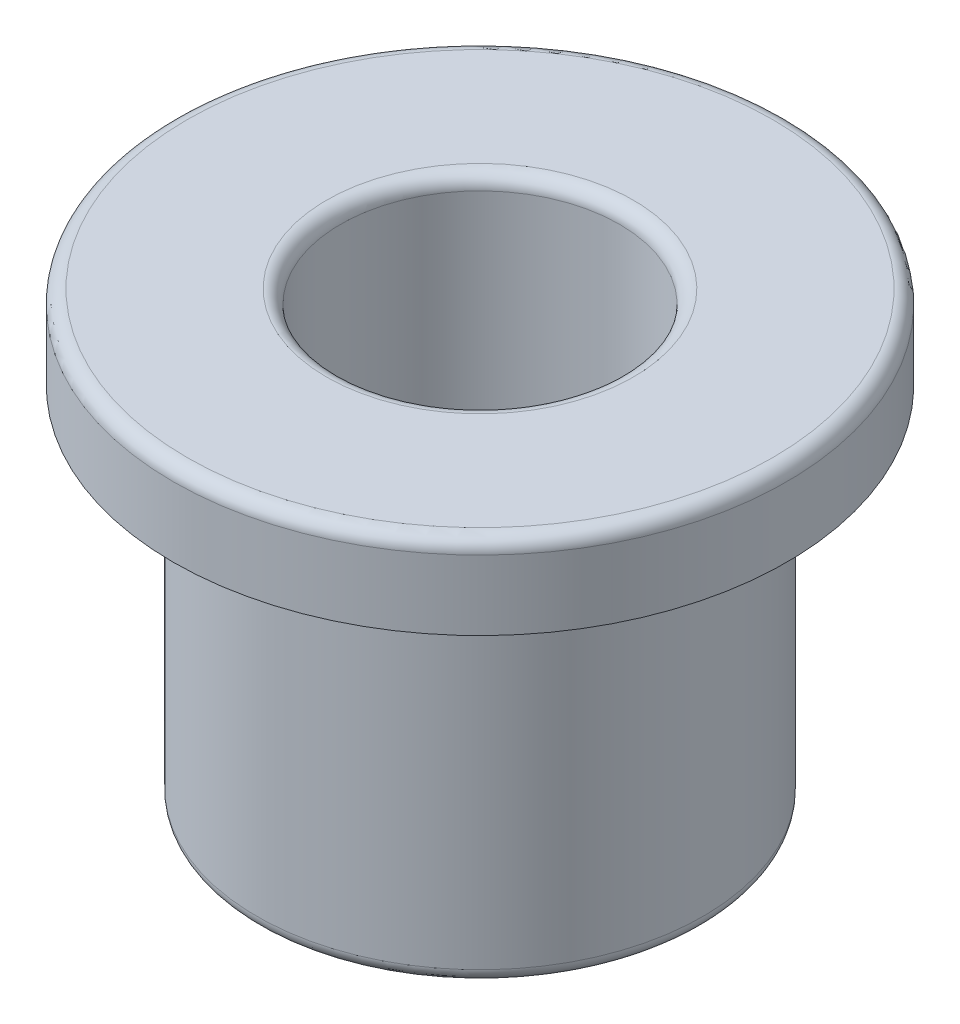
ISO-10303-21;
HEADER;
FILE_DESCRIPTION(('STEP AP214'),'2;1');
FILE_NAME('part.step','',(''),(''),'','','');
FILE_SCHEMA(('AUTOMOTIVE_DESIGN { 1 0 10303 214 1 1 1 1 }'));
ENDSEC;
DATA;
#1=APPLICATION_CONTEXT('core data for automotive mechanical design processes');
#2=APPLICATION_PROTOCOL_DEFINITION('international standard','automotive_design',2000,#1);
#3=PRODUCT_CONTEXT('',#1,'mechanical');
#4=PRODUCT('Part','Part','',(#3));
#5=PRODUCT_RELATED_PRODUCT_CATEGORY('part','',(#4));
#6=PRODUCT_DEFINITION_FORMATION('','',#4);
#7=PRODUCT_DEFINITION_CONTEXT('part definition',#1,'design');
#8=PRODUCT_DEFINITION('design','',#6,#7);
#9=PRODUCT_DEFINITION_SHAPE('','',#8);
#10=(LENGTH_UNIT() NAMED_UNIT(*) SI_UNIT(.MILLI.,.METRE.));
#11=(NAMED_UNIT(*) PLANE_ANGLE_UNIT() SI_UNIT($,.RADIAN.));
#12=(NAMED_UNIT(*) SI_UNIT($,.STERADIAN.) SOLID_ANGLE_UNIT());
#13=UNCERTAINTY_MEASURE_WITH_UNIT(LENGTH_MEASURE(1.E-05),#10,'distance_accuracy_value','');
#14=(GEOMETRIC_REPRESENTATION_CONTEXT(3) GLOBAL_UNCERTAINTY_ASSIGNED_CONTEXT((#13)) GLOBAL_UNIT_ASSIGNED_CONTEXT((#10,
#11,#12)) REPRESENTATION_CONTEXT('',''));
#15=CARTESIAN_POINT('',(0.,0.,0.));
#16=DIRECTION('',(0.,0.,1.));
#17=DIRECTION('',(1.,0.,0.));
#18=AXIS2_PLACEMENT_3D('',#15,#16,#17);
#19=CARTESIAN_POINT('',(0.,0.,0.));
#20=DIRECTION('',(0.,-0.999999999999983,0.));
#21=DIRECTION('',(0.,0.,-1.00000000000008));
#22=AXIS2_PLACEMENT_3D('',#19,#20,#21);
#23=CYLINDRICAL_SURFACE('',#22,5.);
#24=CARTESIAN_POINT('',(0.,15.4999999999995,0.));
#25=DIRECTION('',(0.,0.999999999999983,0.));
#26=DIRECTION('',(0.,0.,1.00000000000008));
#27=AXIS2_PLACEMENT_3D('',#24,#25,#26);
#28=CIRCLE('',#27,5.);
#29=CARTESIAN_POINT('',(0.,15.4999999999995,-5.00000000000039));
#30=VERTEX_POINT('',#29);
#31=EDGE_CURVE('E48',#30,#30,#28,.T.);
#32=CARTESIAN_POINT('',(0.,0.5,0.));
#33=DIRECTION('',(0.,-0.999999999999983,0.));
#34=DIRECTION('',(0.,0.,-1.00000000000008));
#35=AXIS2_PLACEMENT_3D('',#32,#33,#34);
#36=CIRCLE('',#35,5.);
#37=CARTESIAN_POINT('',(0.,0.500000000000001,-5.00000000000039));
#38=VERTEX_POINT('',#37);
#39=EDGE_CURVE('E51',#38,#38,#36,.T.);
#40=CARTESIAN_POINT('',(0.,15.4999999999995,-5.00000000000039));
#41=CARTESIAN_POINT('',(0.,15.3437499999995,-5.00000000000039));
#42=CARTESIAN_POINT('',(0.,15.1874999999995,-5.00000000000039));
#43=CARTESIAN_POINT('',(0.,14.8749999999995,-5.00000000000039));
#44=CARTESIAN_POINT('',(0.,14.7187499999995,-5.00000000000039));
#45=CARTESIAN_POINT('',(0.,14.4062499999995,-5.00000000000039));
#46=CARTESIAN_POINT('',(0.,14.2499999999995,-5.00000000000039));
#47=CARTESIAN_POINT('',(0.,13.9374999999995,-5.00000000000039));
#48=CARTESIAN_POINT('',(0.,13.7812499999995,-5.00000000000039));
#49=CARTESIAN_POINT('',(0.,13.4687499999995,-5.00000000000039));
#50=CARTESIAN_POINT('',(0.,13.3124999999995,-5.00000000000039));
#51=CARTESIAN_POINT('',(0.,12.9999999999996,-5.00000000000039));
#52=CARTESIAN_POINT('',(0.,12.8437499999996,-5.00000000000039));
#53=CARTESIAN_POINT('',(0.,12.5312499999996,-5.00000000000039));
#54=CARTESIAN_POINT('',(0.,12.3749999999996,-5.00000000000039));
#55=CARTESIAN_POINT('',(0.,12.0624999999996,-5.00000000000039));
#56=CARTESIAN_POINT('',(0.,11.9062499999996,-5.00000000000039));
#57=CARTESIAN_POINT('',(0.,11.5937499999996,-5.00000000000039));
#58=CARTESIAN_POINT('',(0.,11.4374999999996,-5.00000000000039));
#59=CARTESIAN_POINT('',(0.,11.1249999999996,-5.00000000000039));
#60=CARTESIAN_POINT('',(0.,10.9687499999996,-5.00000000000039));
#61=CARTESIAN_POINT('',(0.,10.6562499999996,-5.00000000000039));
#62=CARTESIAN_POINT('',(0.,10.4999999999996,-5.00000000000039));
#63=CARTESIAN_POINT('',(0.,10.1874999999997,-5.00000000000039));
#64=CARTESIAN_POINT('',(0.,10.0312499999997,-5.00000000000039));
#65=CARTESIAN_POINT('',(0.,9.71874999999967,-5.00000000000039));
#66=CARTESIAN_POINT('',(0.,9.56249999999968,-5.00000000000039));
#67=CARTESIAN_POINT('',(0.,9.24999999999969,-5.00000000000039));
#68=CARTESIAN_POINT('',(0.,9.0937499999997,-5.00000000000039));
#69=CARTESIAN_POINT('',(0.,8.78124999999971,-5.00000000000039));
#70=CARTESIAN_POINT('',(0.,8.62499999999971,-5.00000000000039));
#71=CARTESIAN_POINT('',(0.,8.31249999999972,-5.00000000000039));
#72=CARTESIAN_POINT('',(0.,8.15624999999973,-5.00000000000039));
#73=CARTESIAN_POINT('',(0.,7.84374999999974,-5.00000000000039));
#74=CARTESIAN_POINT('',(0.,7.68749999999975,-5.00000000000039));
#75=CARTESIAN_POINT('',(0.,7.37499999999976,-5.00000000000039));
#76=CARTESIAN_POINT('',(0.,7.21874999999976,-5.00000000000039));
#77=CARTESIAN_POINT('',(0.,6.90624999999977,-5.00000000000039));
#78=CARTESIAN_POINT('',(0.,6.74999999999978,-5.00000000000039));
#79=CARTESIAN_POINT('',(0.,6.43749999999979,-5.00000000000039));
#80=CARTESIAN_POINT('',(0.,6.28124999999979,-5.00000000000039));
#81=CARTESIAN_POINT('',(0.,5.96874999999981,-5.00000000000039));
#82=CARTESIAN_POINT('',(0.,5.81249999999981,-5.00000000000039));
#83=CARTESIAN_POINT('',(0.,5.49999999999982,-5.00000000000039));
#84=CARTESIAN_POINT('',(0.,5.34374999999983,-5.00000000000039));
#85=CARTESIAN_POINT('',(0.,5.03124999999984,-5.00000000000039));
#86=CARTESIAN_POINT('',(0.,4.87499999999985,-5.00000000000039));
#87=CARTESIAN_POINT('',(0.,4.56249999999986,-5.00000000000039));
#88=CARTESIAN_POINT('',(0.,4.40624999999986,-5.00000000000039));
#89=CARTESIAN_POINT('',(0.,4.09374999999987,-5.00000000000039));
#90=CARTESIAN_POINT('',(0.,3.93749999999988,-5.00000000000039));
#91=CARTESIAN_POINT('',(0.,3.62499999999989,-5.00000000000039));
#92=CARTESIAN_POINT('',(0.,3.4687499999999,-5.00000000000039));
#93=CARTESIAN_POINT('',(0.,3.15624999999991,-5.00000000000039));
#94=CARTESIAN_POINT('',(0.,2.99999999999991,-5.00000000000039));
#95=CARTESIAN_POINT('',(0.,2.68749999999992,-5.00000000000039));
#96=CARTESIAN_POINT('',(0.,2.53124999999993,-5.00000000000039));
#97=CARTESIAN_POINT('',(0.,2.21874999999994,-5.00000000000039));
#98=CARTESIAN_POINT('',(0.,2.06249999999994,-5.00000000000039));
#99=CARTESIAN_POINT('',(0.,1.74999999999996,-5.00000000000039));
#100=CARTESIAN_POINT('',(0.,1.59374999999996,-5.00000000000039));
#101=CARTESIAN_POINT('',(0.,1.28124999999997,-5.00000000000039));
#102=CARTESIAN_POINT('',(0.,1.12499999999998,-5.00000000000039));
#103=CARTESIAN_POINT('',(0.,0.81249999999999,-5.00000000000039));
#104=CARTESIAN_POINT('',(0.,0.656249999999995,-5.00000000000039));
#105=CARTESIAN_POINT('',(0.,0.500000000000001,-5.00000000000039));
#106=B_SPLINE_CURVE_WITH_KNOTS('',3,(#40,#41,#42,#43,#44,#45,#46,#47,#48,#49,#50,#51,#52,#53,
#54,#55,#56,#57,#58,#59,#60,#61,#62,#63,#64,#65,#66,#67,#68,#69,#70,#71,#72,#73,#74,#75,#76,#77,
#78,#79,#80,#81,#82,#83,#84,#85,#86,#87,#88,#89,#90,#91,#92,#93,#94,#95,#96,#97,#98,#99,#100,
#101,#102,#103,#104,#105),.UNSPECIFIED.,.F.,.F.,(4,2,2,2,2,2,2,2,2,2,2,2,2,2,2,2,2,2,2,2,2,2,2,
2,2,2,2,2,2,2,2,2,4),(0.,0.468749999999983,0.937499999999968,1.40624999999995,1.87499999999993,
2.34374999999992,2.8124999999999,3.28124999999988,3.74999999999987,4.21874999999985,
4.68749999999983,5.15624999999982,5.6249999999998,6.09374999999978,6.56249999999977,
7.03124999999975,7.49999999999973,7.96874999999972,8.4374999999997,8.90624999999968,
9.37499999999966,9.84374999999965,10.3124999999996,10.7812499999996,11.2499999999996,
11.7187499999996,12.1874999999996,12.6562499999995,13.1249999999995,13.5937499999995,
14.0624999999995,14.5312499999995,14.9999999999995),.UNSPECIFIED.);
#107=EDGE_CURVE('BSEAM26',#30,#38,#106,.T.);
#108=ORIENTED_EDGE('',*,*,#31,.T.);
#109=ORIENTED_EDGE('',*,*,#39,.T.);
#110=ORIENTED_EDGE('',*,*,#107,.T.);
#111=ORIENTED_EDGE('',*,*,#107,.F.);
#112=EDGE_LOOP('',(#108,#110,#109,#111));
#113=FACE_BOUND('',#112,.T.);
#114=ADVANCED_FACE('F26',(#113),#23,.F.);
#115=CARTESIAN_POINT('',(5.00000000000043,15.9999999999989,0.));
#116=DIRECTION('',(0.,0.999999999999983,0.));
#117=DIRECTION('',(0.,0.,1.00000000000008));
#118=AXIS2_PLACEMENT_3D('',#115,#116,#117);
#119=PLANE('',#118);
#120=CARTESIAN_POINT('',(0.,15.9999999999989,0.));
#121=DIRECTION('',(0.,0.999999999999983,0.));
#122=DIRECTION('',(0.,0.,1.00000000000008));
#123=AXIS2_PLACEMENT_3D('',#120,#121,#122);
#124=CIRCLE('',#123,10.5);
#125=CARTESIAN_POINT('',(0.,15.9999999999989,10.5000000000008));
#126=VERTEX_POINT('',#125);
#127=EDGE_CURVE('E54',#126,#126,#124,.T.);
#128=ORIENTED_EDGE('',*,*,#127,.T.);
#129=EDGE_LOOP('',(#128));
#130=FACE_BOUND('',#129,.T.);
#131=CARTESIAN_POINT('',(0.,15.9999999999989,0.));
#132=DIRECTION('',(0.,0.999999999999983,0.));
#133=DIRECTION('',(0.,0.,1.00000000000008));
#134=AXIS2_PLACEMENT_3D('',#131,#132,#133);
#135=CIRCLE('',#134,5.5);
#136=CARTESIAN_POINT('',(0.,15.9999999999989,5.50000000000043));
#137=VERTEX_POINT('',#136);
#138=EDGE_CURVE('E57',#137,#137,#135,.F.);
#139=ORIENTED_EDGE('',*,*,#138,.T.);
#140=EDGE_LOOP('',(#139));
#141=FACE_BOUND('',#140,.T.);
#142=ADVANCED_FACE('F71',(#130,#141),#119,.T.);
#143=CARTESIAN_POINT('',(0.,0.,0.));
#144=DIRECTION('',(0.,-0.999999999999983,0.));
#145=DIRECTION('',(0.,0.,-1.00000000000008));
#146=AXIS2_PLACEMENT_3D('',#143,#144,#145);
#147=CYLINDRICAL_SURFACE('',#146,11.);
#148=CARTESIAN_POINT('',(0.,15.4999999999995,0.));
#149=DIRECTION('',(0.,0.999999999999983,0.));
#150=DIRECTION('',(0.,0.,1.00000000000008));
#151=AXIS2_PLACEMENT_3D('',#148,#149,#150);
#152=CIRCLE('',#151,11.);
#153=CARTESIAN_POINT('',(0.,15.4999999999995,-11.0000000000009));
#154=VERTEX_POINT('',#153);
#155=EDGE_CURVE('E60',#154,#154,#152,.F.);
#156=CARTESIAN_POINT('',(0.,12.9999999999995,0.));
#157=DIRECTION('',(0.,-0.999999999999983,0.));
#158=DIRECTION('',(0.,0.,-1.00000000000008));
#159=AXIS2_PLACEMENT_3D('',#156,#157,#158);
#160=CIRCLE('',#159,11.);
#161=CARTESIAN_POINT('',(0.,12.9999999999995,-11.0000000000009));
#162=VERTEX_POINT('',#161);
#163=EDGE_CURVE('E63',#162,#162,#160,.T.);
#164=CARTESIAN_POINT('',(0.,15.4999999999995,-11.0000000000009));
#165=CARTESIAN_POINT('',(0.,15.4739583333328,-11.0000000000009));
#166=CARTESIAN_POINT('',(0.,15.4479166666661,-11.0000000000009));
#167=CARTESIAN_POINT('',(0.,15.3958333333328,-11.0000000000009));
#168=CARTESIAN_POINT('',(0.,15.3697916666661,-11.0000000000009));
#169=CARTESIAN_POINT('',(0.,15.3177083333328,-11.0000000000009));
#170=CARTESIAN_POINT('',(0.,15.2916666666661,-11.0000000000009));
#171=CARTESIAN_POINT('',(0.,15.2395833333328,-11.0000000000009));
#172=CARTESIAN_POINT('',(0.,15.2135416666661,-11.0000000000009));
#173=CARTESIAN_POINT('',(0.,15.1614583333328,-11.0000000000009));
#174=CARTESIAN_POINT('',(0.,15.1354166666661,-11.0000000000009));
#175=CARTESIAN_POINT('',(0.,15.0833333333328,-11.0000000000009));
#176=CARTESIAN_POINT('',(0.,15.0572916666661,-11.0000000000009));
#177=CARTESIAN_POINT('',(0.,15.0052083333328,-11.0000000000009));
#178=CARTESIAN_POINT('',(0.,14.9791666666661,-11.0000000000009));
#179=CARTESIAN_POINT('',(0.,14.9270833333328,-11.0000000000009));
#180=CARTESIAN_POINT('',(0.,14.9010416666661,-11.0000000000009));
#181=CARTESIAN_POINT('',(0.,14.8489583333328,-11.0000000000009));
#182=CARTESIAN_POINT('',(0.,14.8229166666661,-11.0000000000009));
#183=CARTESIAN_POINT('',(0.,14.7708333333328,-11.0000000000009));
#184=CARTESIAN_POINT('',(0.,14.7447916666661,-11.0000000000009));
#185=CARTESIAN_POINT('',(0.,14.6927083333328,-11.0000000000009));
#186=CARTESIAN_POINT('',(0.,14.6666666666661,-11.0000000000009));
#187=CARTESIAN_POINT('',(0.,14.6145833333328,-11.0000000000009));
#188=CARTESIAN_POINT('',(0.,14.5885416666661,-11.0000000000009));
#189=CARTESIAN_POINT('',(0.,14.5364583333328,-11.0000000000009));
#190=CARTESIAN_POINT('',(0.,14.5104166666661,-11.0000000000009));
#191=CARTESIAN_POINT('',(0.,14.4583333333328,-11.0000000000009));
#192=CARTESIAN_POINT('',(0.,14.4322916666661,-11.0000000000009));
#193=CARTESIAN_POINT('',(0.,14.3802083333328,-11.0000000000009));
#194=CARTESIAN_POINT('',(0.,14.3541666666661,-11.0000000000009));
#195=CARTESIAN_POINT('',(0.,14.3020833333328,-11.0000000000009));
#196=CARTESIAN_POINT('',(0.,14.2760416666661,-11.0000000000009));
#197=CARTESIAN_POINT('',(0.,14.2239583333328,-11.0000000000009));
#198=CARTESIAN_POINT('',(0.,14.1979166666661,-11.0000000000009));
#199=CARTESIAN_POINT('',(0.,14.1458333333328,-11.0000000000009));
#200=CARTESIAN_POINT('',(0.,14.1197916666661,-11.0000000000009));
#201=CARTESIAN_POINT('',(0.,14.0677083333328,-11.0000000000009));
#202=CARTESIAN_POINT('',(0.,14.0416666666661,-11.0000000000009));
#203=CARTESIAN_POINT('',(0.,13.9895833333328,-11.0000000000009));
#204=CARTESIAN_POINT('',(0.,13.9635416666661,-11.0000000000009));
#205=CARTESIAN_POINT('',(0.,13.9114583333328,-11.0000000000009));
#206=CARTESIAN_POINT('',(0.,13.8854166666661,-11.0000000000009));
#207=CARTESIAN_POINT('',(0.,13.8333333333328,-11.0000000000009));
#208=CARTESIAN_POINT('',(0.,13.8072916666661,-11.0000000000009));
#209=CARTESIAN_POINT('',(0.,13.7552083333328,-11.0000000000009));
#210=CARTESIAN_POINT('',(0.,13.7291666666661,-11.0000000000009));
#211=CARTESIAN_POINT('',(0.,13.6770833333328,-11.0000000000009));
#212=CARTESIAN_POINT('',(0.,13.6510416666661,-11.0000000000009));
#213=CARTESIAN_POINT('',(0.,13.5989583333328,-11.0000000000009));
#214=CARTESIAN_POINT('',(0.,13.5729166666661,-11.0000000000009));
#215=CARTESIAN_POINT('',(0.,13.5208333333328,-11.0000000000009));
#216=CARTESIAN_POINT('',(0.,13.4947916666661,-11.0000000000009));
#217=CARTESIAN_POINT('',(0.,13.4427083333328,-11.0000000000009));
#218=CARTESIAN_POINT('',(0.,13.4166666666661,-11.0000000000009));
#219=CARTESIAN_POINT('',(0.,13.3645833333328,-11.0000000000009));
#220=CARTESIAN_POINT('',(0.,13.3385416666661,-11.0000000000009));
#221=CARTESIAN_POINT('',(0.,13.2864583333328,-11.0000000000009));
#222=CARTESIAN_POINT('',(0.,13.2604166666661,-11.0000000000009));
#223=CARTESIAN_POINT('',(0.,13.2083333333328,-11.0000000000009));
#224=CARTESIAN_POINT('',(0.,13.1822916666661,-11.0000000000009));
#225=CARTESIAN_POINT('',(0.,13.1302083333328,-11.0000000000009));
#226=CARTESIAN_POINT('',(0.,13.1041666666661,-11.0000000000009));
#227=CARTESIAN_POINT('',(0.,13.0520833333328,-11.0000000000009));
#228=CARTESIAN_POINT('',(0.,13.0260416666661,-11.0000000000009));
#229=CARTESIAN_POINT('',(0.,12.9999999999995,-11.0000000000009));
#230=B_SPLINE_CURVE_WITH_KNOTS('',3,(#164,#165,#166,#167,#168,#169,#170,#171,#172,#173,#174,
#175,#176,#177,#178,#179,#180,#181,#182,#183,#184,#185,#186,#187,#188,#189,#190,#191,#192,#193,
#194,#195,#196,#197,#198,#199,#200,#201,#202,#203,#204,#205,#206,#207,#208,#209,#210,#211,#212,
#213,#214,#215,#216,#217,#218,#219,#220,#221,#222,#223,#224,#225,#226,#227,#228,#229),
.UNSPECIFIED.,.F.,.F.,(4,2,2,2,2,2,2,2,2,2,2,2,2,2,2,2,2,2,2,2,2,2,2,2,2,2,2,2,2,2,2,2,4),(0.,
0.0781250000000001,0.15625,0.234374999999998,0.3125,0.390625,0.46875,0.546875,0.625000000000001,
0.703125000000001,0.781250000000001,0.859375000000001,0.937500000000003,1.015625,1.09375,
1.171875,1.25,1.328125,1.40625,1.484375,1.5625,1.640625,1.71875,1.796875,1.875,1.953125,2.03125,
2.109375,2.1875,2.265625,2.34375,2.421875,2.5),.UNSPECIFIED.);
#231=EDGE_CURVE('BSEAM69',#154,#162,#230,.T.);
#232=ORIENTED_EDGE('',*,*,#155,.T.);
#233=ORIENTED_EDGE('',*,*,#163,.F.);
#234=ORIENTED_EDGE('',*,*,#231,.T.);
#235=ORIENTED_EDGE('',*,*,#231,.F.);
#236=EDGE_LOOP('',(#232,#234,#233,#235));
#237=FACE_BOUND('',#236,.T.);
#238=ADVANCED_FACE('F69',(#237),#147,.T.);
#239=CARTESIAN_POINT('',(8.00000000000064,12.9999999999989,0.));
#240=DIRECTION('',(0.,-0.999999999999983,0.));
#241=DIRECTION('',(0.,0.,-1.00000000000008));
#242=AXIS2_PLACEMENT_3D('',#239,#240,#241);
#243=PLANE('',#242);
#244=CARTESIAN_POINT('',(0.,12.9999999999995,0.));
#245=DIRECTION('',(0.,-0.999999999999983,0.));
#246=DIRECTION('',(0.,0.,-1.00000000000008));
#247=AXIS2_PLACEMENT_3D('',#244,#245,#246);
#248=CIRCLE('',#247,8.5);
#249=CARTESIAN_POINT('',(0.,12.9999999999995,-8.50000000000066));
#250=VERTEX_POINT('',#249);
#251=EDGE_CURVE('E10',#250,#250,#248,.F.);
#252=ORIENTED_EDGE('',*,*,#251,.T.);
#253=EDGE_LOOP('',(#252));
#254=FACE_BOUND('',#253,.T.);
#255=ORIENTED_EDGE('',*,*,#163,.T.);
#256=EDGE_LOOP('',(#255));
#257=FACE_BOUND('',#256,.T.);
#258=ADVANCED_FACE('F67',(#254,#257),#243,.T.);
#259=CARTESIAN_POINT('',(0.,0.,0.));
#260=DIRECTION('',(0.,-0.999999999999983,0.));
#261=DIRECTION('',(0.,0.,-1.00000000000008));
#262=AXIS2_PLACEMENT_3D('',#259,#260,#261);
#263=CYLINDRICAL_SURFACE('',#262,8.);
#264=CARTESIAN_POINT('',(0.,0.5,0.));
#265=DIRECTION('',(0.,-0.999999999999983,0.));
#266=DIRECTION('',(0.,0.,-1.00000000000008));
#267=AXIS2_PLACEMENT_3D('',#264,#265,#266);
#268=CIRCLE('',#267,8.);
#269=CARTESIAN_POINT('',(0.,0.500000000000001,-8.00000000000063));
#270=VERTEX_POINT('',#269);
#271=EDGE_CURVE('E32',#270,#270,#268,.F.);
#272=CARTESIAN_POINT('',(0.,12.4999999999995,0.));
#273=DIRECTION('',(0.,-0.999999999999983,0.));
#274=DIRECTION('',(0.,0.,-1.00000000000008));
#275=AXIS2_PLACEMENT_3D('',#272,#273,#274);
#276=CIRCLE('',#275,8.);
#277=CARTESIAN_POINT('',(0.,12.4999999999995,-8.00000000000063));
#278=VERTEX_POINT('',#277);
#279=EDGE_CURVE('E36',#278,#278,#276,.T.);
#280=CARTESIAN_POINT('',(0.,0.500000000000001,-8.00000000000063));
#281=CARTESIAN_POINT('',(0.,0.624999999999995,-8.00000000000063));
#282=CARTESIAN_POINT('',(0.,0.749999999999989,-8.00000000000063));
#283=CARTESIAN_POINT('',(0.,0.999999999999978,-8.00000000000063));
#284=CARTESIAN_POINT('',(0.,1.12499999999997,-8.00000000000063));
#285=CARTESIAN_POINT('',(0.,1.37499999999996,-8.00000000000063));
#286=CARTESIAN_POINT('',(0.,1.49999999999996,-8.00000000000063));
#287=CARTESIAN_POINT('',(0.,1.74999999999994,-8.00000000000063));
#288=CARTESIAN_POINT('',(0.,1.87499999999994,-8.00000000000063));
#289=CARTESIAN_POINT('',(0.,2.12499999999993,-8.00000000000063));
#290=CARTESIAN_POINT('',(0.,2.24999999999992,-8.00000000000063));
#291=CARTESIAN_POINT('',(0.,2.49999999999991,-8.00000000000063));
#292=CARTESIAN_POINT('',(0.,2.62499999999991,-8.00000000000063));
#293=CARTESIAN_POINT('',(0.,2.87499999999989,-8.00000000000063));
#294=CARTESIAN_POINT('',(0.,2.99999999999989,-8.00000000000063));
#295=CARTESIAN_POINT('',(0.,3.24999999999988,-8.00000000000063));
#296=CARTESIAN_POINT('',(0.,3.37499999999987,-8.00000000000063));
#297=CARTESIAN_POINT('',(0.,3.62499999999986,-8.00000000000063));
#298=CARTESIAN_POINT('',(0.,3.74999999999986,-8.00000000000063));
#299=CARTESIAN_POINT('',(0.,3.99999999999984,-8.00000000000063));
#300=CARTESIAN_POINT('',(0.,4.12499999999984,-8.00000000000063));
#301=CARTESIAN_POINT('',(0.,4.37499999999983,-8.00000000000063));
#302=CARTESIAN_POINT('',(0.,4.49999999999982,-8.00000000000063));
#303=CARTESIAN_POINT('',(0.,4.74999999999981,-8.00000000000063));
#304=CARTESIAN_POINT('',(0.,4.8749999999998,-8.00000000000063));
#305=CARTESIAN_POINT('',(0.,5.12499999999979,-8.00000000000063));
#306=CARTESIAN_POINT('',(0.,5.24999999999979,-8.00000000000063));
#307=CARTESIAN_POINT('',(0.,5.49999999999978,-8.00000000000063));
#308=CARTESIAN_POINT('',(0.,5.62499999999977,-8.00000000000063));
#309=CARTESIAN_POINT('',(0.,5.87499999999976,-8.00000000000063));
#310=CARTESIAN_POINT('',(0.,5.99999999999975,-8.00000000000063));
#311=CARTESIAN_POINT('',(0.,6.24999999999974,-8.00000000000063));
#312=CARTESIAN_POINT('',(0.,6.37499999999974,-8.00000000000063));
#313=CARTESIAN_POINT('',(0.,6.62499999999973,-8.00000000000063));
#314=CARTESIAN_POINT('',(0.,6.74999999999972,-8.00000000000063));
#315=CARTESIAN_POINT('',(0.,6.99999999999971,-8.00000000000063));
#316=CARTESIAN_POINT('',(0.,7.1249999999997,-8.00000000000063));
#317=CARTESIAN_POINT('',(0.,7.37499999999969,-8.00000000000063));
#318=CARTESIAN_POINT('',(0.,7.49999999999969,-8.00000000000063));
#319=CARTESIAN_POINT('',(0.,7.74999999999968,-8.00000000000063));
#320=CARTESIAN_POINT('',(0.,7.87499999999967,-8.00000000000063));
#321=CARTESIAN_POINT('',(0.,8.12499999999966,-8.00000000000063));
#322=CARTESIAN_POINT('',(0.,8.24999999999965,-8.00000000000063));
#323=CARTESIAN_POINT('',(0.,8.49999999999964,-8.00000000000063));
#324=CARTESIAN_POINT('',(0.,8.62499999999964,-8.00000000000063));
#325=CARTESIAN_POINT('',(0.,8.87499999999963,-8.00000000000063));
#326=CARTESIAN_POINT('',(0.,8.99999999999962,-8.00000000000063));
#327=CARTESIAN_POINT('',(0.,9.24999999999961,-8.00000000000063));
#328=CARTESIAN_POINT('',(0.,9.3749999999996,-8.00000000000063));
#329=CARTESIAN_POINT('',(0.,9.62499999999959,-8.00000000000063));
#330=CARTESIAN_POINT('',(0.,9.74999999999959,-8.00000000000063));
#331=CARTESIAN_POINT('',(0.,9.99999999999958,-8.00000000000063));
#332=CARTESIAN_POINT('',(0.,10.1249999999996,-8.00000000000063));
#333=CARTESIAN_POINT('',(0.,10.3749999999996,-8.00000000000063));
#334=CARTESIAN_POINT('',(0.,10.4999999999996,-8.00000000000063));
#335=CARTESIAN_POINT('',(0.,10.7499999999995,-8.00000000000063));
#336=CARTESIAN_POINT('',(0.,10.8749999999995,-8.00000000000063));
#337=CARTESIAN_POINT('',(0.,11.1249999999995,-8.00000000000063));
#338=CARTESIAN_POINT('',(0.,11.2499999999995,-8.00000000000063));
#339=CARTESIAN_POINT('',(0.,11.4999999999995,-8.00000000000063));
#340=CARTESIAN_POINT('',(0.,11.6249999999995,-8.00000000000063));
#341=CARTESIAN_POINT('',(0.,11.8749999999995,-8.00000000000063));
#342=CARTESIAN_POINT('',(0.,11.9999999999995,-8.00000000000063));
#343=CARTESIAN_POINT('',(0.,12.2499999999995,-8.00000000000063));
#344=CARTESIAN_POINT('',(0.,12.3749999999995,-8.00000000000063));
#345=CARTESIAN_POINT('',(0.,12.4999999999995,-8.00000000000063));
#346=B_SPLINE_CURVE_WITH_KNOTS('',3,(#280,#281,#282,#283,#284,#285,#286,#287,#288,#289,#290,
#291,#292,#293,#294,#295,#296,#297,#298,#299,#300,#301,#302,#303,#304,#305,#306,#307,#308,#309,
#310,#311,#312,#313,#314,#315,#316,#317,#318,#319,#320,#321,#322,#323,#324,#325,#326,#327,#328,
#329,#330,#331,#332,#333,#334,#335,#336,#337,#338,#339,#340,#341,#342,#343,#344,#345),
.UNSPECIFIED.,.F.,.F.,(4,2,2,2,2,2,2,2,2,2,2,2,2,2,2,2,2,2,2,2,2,2,2,2,2,2,2,2,2,2,2,2,4),(0.,
0.374999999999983,0.749999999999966,1.12499999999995,1.49999999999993,1.87499999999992,
2.2499999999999,2.62499999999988,2.99999999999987,3.37499999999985,3.74999999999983,
4.12499999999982,4.4999999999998,4.87499999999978,5.24999999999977,5.62499999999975,
5.99999999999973,6.37499999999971,6.7499999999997,7.12499999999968,7.49999999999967,
7.87499999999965,8.24999999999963,8.62499999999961,8.9999999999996,9.37499999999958,
9.74999999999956,10.1249999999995,10.4999999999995,10.8749999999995,11.2499999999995,
11.6249999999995,11.9999999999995),.UNSPECIFIED.);
#347=EDGE_CURVE('BSEAM78',#270,#278,#346,.T.);
#348=ORIENTED_EDGE('',*,*,#271,.T.);
#349=ORIENTED_EDGE('',*,*,#279,.T.);
#350=ORIENTED_EDGE('',*,*,#347,.T.);
#351=ORIENTED_EDGE('',*,*,#347,.F.);
#352=EDGE_LOOP('',(#348,#350,#349,#351));
#353=FACE_BOUND('',#352,.T.);
#354=ADVANCED_FACE('F78',(#353),#263,.T.);
#355=CARTESIAN_POINT('',(5.00000000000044,0.,0.));
#356=DIRECTION('',(0.,-0.999999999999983,0.));
#357=DIRECTION('',(0.,0.,-1.00000000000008));
#358=AXIS2_PLACEMENT_3D('',#355,#356,#357);
#359=PLANE('',#358);
#360=CARTESIAN_POINT('',(0.,0.,0.));
#361=DIRECTION('',(0.,-0.999999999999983,0.));
#362=DIRECTION('',(0.,0.,-1.00000000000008));
#363=AXIS2_PLACEMENT_3D('',#360,#361,#362);
#364=CIRCLE('',#363,5.5);
#365=CARTESIAN_POINT('',(0.,0.,-5.50000000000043));
#366=VERTEX_POINT('',#365);
#367=EDGE_CURVE('E40',#366,#366,#364,.F.);
#368=ORIENTED_EDGE('',*,*,#367,.T.);
#369=EDGE_LOOP('',(#368));
#370=FACE_BOUND('',#369,.T.);
#371=CARTESIAN_POINT('',(0.,0.,0.));
#372=DIRECTION('',(0.,-0.999999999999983,0.));
#373=DIRECTION('',(0.,0.,-1.00000000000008));
#374=AXIS2_PLACEMENT_3D('',#371,#372,#373);
#375=CIRCLE('',#374,7.5);
#376=CARTESIAN_POINT('',(0.,0.,-7.50000000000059));
#377=VERTEX_POINT('',#376);
#378=EDGE_CURVE('E45',#377,#377,#375,.T.);
#379=ORIENTED_EDGE('',*,*,#378,.T.);
#380=EDGE_LOOP('',(#379));
#381=FACE_BOUND('',#380,.T.);
#382=ADVANCED_FACE('F110',(#370,#381),#359,.T.);
#383=CARTESIAN_POINT('',(0.,15.4999999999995,0.));
#384=DIRECTION('',(0.,0.999999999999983,0.));
#385=DIRECTION('',(0.,0.,1.00000000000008));
#386=AXIS2_PLACEMENT_3D('',#383,#384,#385);
#387=TOROIDAL_SURFACE('',#386,10.5,0.5);
#388=ORIENTED_EDGE('',*,*,#127,.F.);
#389=EDGE_LOOP('',(#388));
#390=FACE_BOUND('',#389,.T.);
#391=ORIENTED_EDGE('',*,*,#155,.F.);
#392=EDGE_LOOP('',(#391));
#393=FACE_BOUND('',#392,.T.);
#394=ADVANCED_FACE('F102',(#390,#393),#387,.T.);
#395=CARTESIAN_POINT('',(0.,15.4999999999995,0.));
#396=DIRECTION('',(0.,0.999999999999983,0.));
#397=DIRECTION('',(0.,0.,1.00000000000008));
#398=AXIS2_PLACEMENT_3D('',#395,#396,#397);
#399=TOROIDAL_SURFACE('',#398,5.5,0.5);
#400=ORIENTED_EDGE('',*,*,#31,.F.);
#401=EDGE_LOOP('',(#400));
#402=FACE_BOUND('',#401,.T.);
#403=ORIENTED_EDGE('',*,*,#138,.F.);
#404=EDGE_LOOP('',(#403));
#405=FACE_BOUND('',#404,.T.);
#406=ADVANCED_FACE('F92',(#402,#405),#399,.T.);
#407=CARTESIAN_POINT('',(0.,0.5,0.));
#408=DIRECTION('',(0.,-0.999999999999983,0.));
#409=DIRECTION('',(0.,0.,-1.00000000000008));
#410=AXIS2_PLACEMENT_3D('',#407,#408,#409);
#411=TOROIDAL_SURFACE('',#410,5.5,0.5);
#412=ORIENTED_EDGE('',*,*,#367,.F.);
#413=EDGE_LOOP('',(#412));
#414=FACE_BOUND('',#413,.T.);
#415=ORIENTED_EDGE('',*,*,#39,.F.);
#416=EDGE_LOOP('',(#415));
#417=FACE_BOUND('',#416,.T.);
#418=ADVANCED_FACE('F89',(#414,#417),#411,.T.);
#419=CARTESIAN_POINT('',(0.,0.5,0.));
#420=DIRECTION('',(0.,-0.999999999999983,0.));
#421=DIRECTION('',(0.,0.,-1.00000000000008));
#422=AXIS2_PLACEMENT_3D('',#419,#420,#421);
#423=TOROIDAL_SURFACE('',#422,7.5,0.5);
#424=ORIENTED_EDGE('',*,*,#271,.F.);
#425=EDGE_LOOP('',(#424));
#426=FACE_BOUND('',#425,.T.);
#427=ORIENTED_EDGE('',*,*,#378,.F.);
#428=EDGE_LOOP('',(#427));
#429=FACE_BOUND('',#428,.T.);
#430=ADVANCED_FACE('F91',(#426,#429),#423,.T.);
#431=CARTESIAN_POINT('',(0.,12.4999999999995,0.));
#432=DIRECTION('',(0.,-0.999999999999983,0.));
#433=DIRECTION('',(0.,0.,-1.00000000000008));
#434=AXIS2_PLACEMENT_3D('',#431,#432,#433);
#435=TOROIDAL_SURFACE('',#434,8.5,0.5);
#436=ORIENTED_EDGE('',*,*,#251,.F.);
#437=EDGE_LOOP('',(#436));
#438=FACE_BOUND('',#437,.T.);
#439=ORIENTED_EDGE('',*,*,#279,.F.);
#440=EDGE_LOOP('',(#439));
#441=FACE_BOUND('',#440,.T.);
#442=ADVANCED_FACE('F99',(#438,#441),#435,.F.);
#443=CLOSED_SHELL('',(#114,#142,#238,#258,#354,#382,#394,#406,#418,#430,#442));
#444=MANIFOLD_SOLID_BREP('B2',#443);
#445=ADVANCED_BREP_SHAPE_REPRESENTATION('',(#18,#444),#14);
#446=SHAPE_DEFINITION_REPRESENTATION(#9,#445);
ENDSEC;
END-ISO-10303-21;
